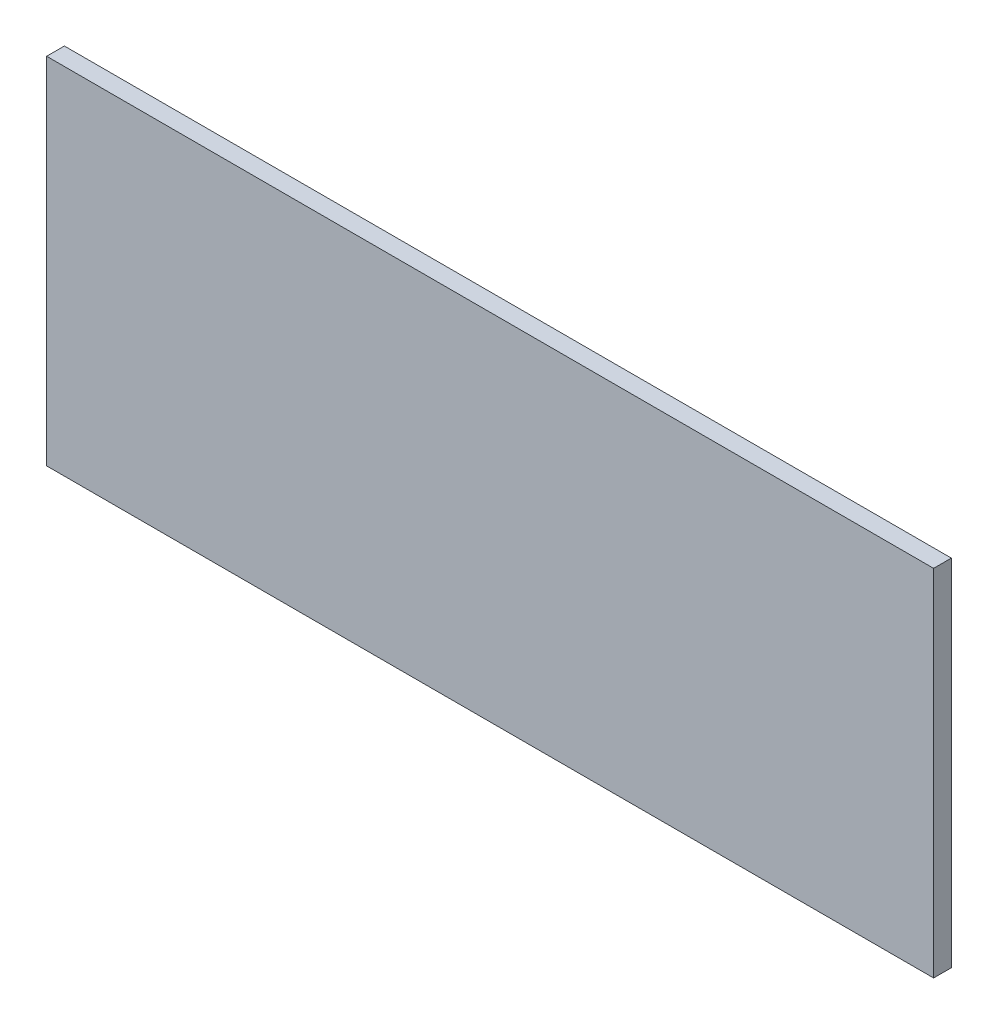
ISO-10303-21;
HEADER;
FILE_DESCRIPTION(('STEP AP214'),'2;1');
FILE_NAME('part.step','',(''),(''),'','','');
FILE_SCHEMA(('AUTOMOTIVE_DESIGN { 1 0 10303 214 1 1 1 1 }'));
ENDSEC;
DATA;
#1=APPLICATION_CONTEXT('core data for automotive mechanical design processes');
#2=APPLICATION_PROTOCOL_DEFINITION('international standard','automotive_design',2000,#1);
#3=PRODUCT_CONTEXT('',#1,'mechanical');
#4=PRODUCT('Part','Part','',(#3));
#5=PRODUCT_RELATED_PRODUCT_CATEGORY('part','',(#4));
#6=PRODUCT_DEFINITION_FORMATION('','',#4);
#7=PRODUCT_DEFINITION_CONTEXT('part definition',#1,'design');
#8=PRODUCT_DEFINITION('design','',#6,#7);
#9=PRODUCT_DEFINITION_SHAPE('','',#8);
#10=(LENGTH_UNIT() NAMED_UNIT(*) SI_UNIT(.MILLI.,.METRE.));
#11=(NAMED_UNIT(*) PLANE_ANGLE_UNIT() SI_UNIT($,.RADIAN.));
#12=(NAMED_UNIT(*) SI_UNIT($,.STERADIAN.) SOLID_ANGLE_UNIT());
#13=UNCERTAINTY_MEASURE_WITH_UNIT(LENGTH_MEASURE(1.E-05),#10,'distance_accuracy_value','');
#14=(GEOMETRIC_REPRESENTATION_CONTEXT(3) GLOBAL_UNCERTAINTY_ASSIGNED_CONTEXT((#13)) GLOBAL_UNIT_ASSIGNED_CONTEXT((#10,
#11,#12)) REPRESENTATION_CONTEXT('',''));
#15=CARTESIAN_POINT('',(0.,0.,0.));
#16=DIRECTION('',(0.,0.,1.));
#17=DIRECTION('',(1.,0.,0.));
#18=AXIS2_PLACEMENT_3D('',#15,#16,#17);
#19=CARTESIAN_POINT('',(-125.,50.,5.));
#20=DIRECTION('',(1.,0.,0.));
#21=DIRECTION('',(0.,1.,0.));
#22=AXIS2_PLACEMENT_3D('',#19,#20,#21);
#23=PLANE('',#22);
#24=DIRECTION('',(0.,-1.,0.));
#25=VECTOR('',#24,1.);
#26=CARTESIAN_POINT('',(-125.,50.,0.));
#27=LINE('',#26,#25);
#28=CARTESIAN_POINT('',(-125.,50.,0.));
#29=VERTEX_POINT('',#28);
#30=CARTESIAN_POINT('',(-125.,-50.,0.));
#31=VERTEX_POINT('',#30);
#32=EDGE_CURVE('E93',#29,#31,#27,.T.);
#33=ORIENTED_EDGE('',*,*,#32,.T.);
#34=DIRECTION('',(0.,0.,-1.));
#35=VECTOR('',#34,1.);
#36=CARTESIAN_POINT('',(-125.,-50.,5.));
#37=LINE('',#36,#35);
#38=CARTESIAN_POINT('',(-125.,-50.,5.));
#39=VERTEX_POINT('',#38);
#40=EDGE_CURVE('E11',#39,#31,#37,.T.);
#41=ORIENTED_EDGE('',*,*,#40,.F.);
#42=DIRECTION('',(0.,-1.,0.));
#43=VECTOR('',#42,1.);
#44=CARTESIAN_POINT('',(-125.,50.,5.));
#45=LINE('',#44,#43);
#46=CARTESIAN_POINT('',(-125.,50.,5.));
#47=VERTEX_POINT('',#46);
#48=EDGE_CURVE('E81',#47,#39,#45,.T.);
#49=ORIENTED_EDGE('',*,*,#48,.F.);
#50=DIRECTION('',(0.,0.,-1.));
#51=VECTOR('',#50,1.);
#52=CARTESIAN_POINT('',(-125.,50.,5.));
#53=LINE('',#52,#51);
#54=EDGE_CURVE('E89',#47,#29,#53,.T.);
#55=ORIENTED_EDGE('',*,*,#54,.T.);
#56=EDGE_LOOP('',(#33,#41,#49,#55));
#57=FACE_BOUND('',#56,.T.);
#58=ADVANCED_FACE('F30',(#57),#23,.F.);
#59=CARTESIAN_POINT('',(-125.,-50.,5.));
#60=DIRECTION('',(0.,1.,0.));
#61=DIRECTION('',(0.,0.,1.));
#62=AXIS2_PLACEMENT_3D('',#59,#60,#61);
#63=PLANE('',#62);
#64=DIRECTION('',(1.,0.,0.));
#65=VECTOR('',#64,1.);
#66=CARTESIAN_POINT('',(-125.,-50.,0.));
#67=LINE('',#66,#65);
#68=CARTESIAN_POINT('',(125.,-50.,0.));
#69=VERTEX_POINT('',#68);
#70=EDGE_CURVE('E85',#31,#69,#67,.T.);
#71=ORIENTED_EDGE('',*,*,#70,.T.);
#72=DIRECTION('',(0.,0.,-1.));
#73=VECTOR('',#72,1.);
#74=CARTESIAN_POINT('',(125.,-50.,5.));
#75=LINE('',#74,#73);
#76=CARTESIAN_POINT('',(125.,-50.,5.));
#77=VERTEX_POINT('',#76);
#78=EDGE_CURVE('E38',#77,#69,#75,.T.);
#79=ORIENTED_EDGE('',*,*,#78,.F.);
#80=DIRECTION('',(1.,0.,0.));
#81=VECTOR('',#80,1.);
#82=CARTESIAN_POINT('',(-125.,-50.,5.));
#83=LINE('',#82,#81);
#84=EDGE_CURVE('E76',#39,#77,#83,.T.);
#85=ORIENTED_EDGE('',*,*,#84,.F.);
#86=ORIENTED_EDGE('',*,*,#40,.T.);
#87=EDGE_LOOP('',(#71,#79,#85,#86));
#88=FACE_BOUND('',#87,.T.);
#89=ADVANCED_FACE('F84',(#88),#63,.F.);
#90=CARTESIAN_POINT('',(125.,50.,5.));
#91=DIRECTION('',(-1.,0.,0.));
#92=DIRECTION('',(0.,0.,1.));
#93=AXIS2_PLACEMENT_3D('',#90,#91,#92);
#94=PLANE('',#93);
#95=DIRECTION('',(0.,1.,0.));
#96=VECTOR('',#95,1.);
#97=CARTESIAN_POINT('',(125.,50.,0.));
#98=LINE('',#97,#96);
#99=CARTESIAN_POINT('',(125.,50.,0.));
#100=VERTEX_POINT('',#99);
#101=EDGE_CURVE('E63',#69,#100,#98,.T.);
#102=ORIENTED_EDGE('',*,*,#101,.T.);
#103=DIRECTION('',(0.,0.,-1.));
#104=VECTOR('',#103,1.);
#105=CARTESIAN_POINT('',(125.,50.,5.));
#106=LINE('',#105,#104);
#107=CARTESIAN_POINT('',(125.,50.,5.));
#108=VERTEX_POINT('',#107);
#109=EDGE_CURVE('E86',#108,#100,#106,.T.);
#110=ORIENTED_EDGE('',*,*,#109,.F.);
#111=DIRECTION('',(0.,1.,0.));
#112=VECTOR('',#111,1.);
#113=CARTESIAN_POINT('',(125.,50.,5.));
#114=LINE('',#113,#112);
#115=EDGE_CURVE('E79',#77,#108,#114,.T.);
#116=ORIENTED_EDGE('',*,*,#115,.F.);
#117=ORIENTED_EDGE('',*,*,#78,.T.);
#118=EDGE_LOOP('',(#102,#110,#116,#117));
#119=FACE_BOUND('',#118,.T.);
#120=ADVANCED_FACE('F87',(#119),#94,.F.);
#121=CARTESIAN_POINT('',(-125.,50.,5.));
#122=DIRECTION('',(0.,-1.,0.));
#123=DIRECTION('',(1.,0.,0.));
#124=AXIS2_PLACEMENT_3D('',#121,#122,#123);
#125=PLANE('',#124);
#126=DIRECTION('',(-1.,0.,0.));
#127=VECTOR('',#126,1.);
#128=CARTESIAN_POINT('',(-125.,50.,0.));
#129=LINE('',#128,#127);
#130=EDGE_CURVE('E69',#100,#29,#129,.T.);
#131=ORIENTED_EDGE('',*,*,#130,.T.);
#132=ORIENTED_EDGE('',*,*,#54,.F.);
#133=DIRECTION('',(-1.,0.,0.));
#134=VECTOR('',#133,1.);
#135=CARTESIAN_POINT('',(-125.,50.,5.));
#136=LINE('',#135,#134);
#137=EDGE_CURVE('E46',#108,#47,#136,.T.);
#138=ORIENTED_EDGE('',*,*,#137,.F.);
#139=ORIENTED_EDGE('',*,*,#109,.T.);
#140=EDGE_LOOP('',(#131,#132,#138,#139));
#141=FACE_BOUND('',#140,.T.);
#142=ADVANCED_FACE('F100',(#141),#125,.F.);
#143=CARTESIAN_POINT('',(-125.,-50.,5.));
#144=DIRECTION('',(0.,0.,1.));
#145=DIRECTION('',(1.,0.,0.));
#146=AXIS2_PLACEMENT_3D('',#143,#144,#145);
#147=PLANE('',#146);
#148=ORIENTED_EDGE('',*,*,#48,.T.);
#149=ORIENTED_EDGE('',*,*,#84,.T.);
#150=ORIENTED_EDGE('',*,*,#115,.T.);
#151=ORIENTED_EDGE('',*,*,#137,.T.);
#152=EDGE_LOOP('',(#148,#149,#150,#151));
#153=FACE_BOUND('',#152,.T.);
#154=ADVANCED_FACE('F77',(#153),#147,.T.);
#155=CARTESIAN_POINT('',(-125.,-50.,0.));
#156=DIRECTION('',(0.,0.,1.));
#157=DIRECTION('',(1.,0.,0.));
#158=AXIS2_PLACEMENT_3D('',#155,#156,#157);
#159=PLANE('',#158);
#160=ORIENTED_EDGE('',*,*,#32,.F.);
#161=ORIENTED_EDGE('',*,*,#130,.F.);
#162=ORIENTED_EDGE('',*,*,#101,.F.);
#163=ORIENTED_EDGE('',*,*,#70,.F.);
#164=EDGE_LOOP('',(#160,#161,#162,#163));
#165=FACE_BOUND('',#164,.T.);
#166=ADVANCED_FACE('F103',(#165),#159,.F.);
#167=CLOSED_SHELL('',(#58,#89,#120,#142,#154,#166));
#168=MANIFOLD_SOLID_BREP('B2',#167);
#169=ADVANCED_BREP_SHAPE_REPRESENTATION('',(#18,#168),#14);
#170=SHAPE_DEFINITION_REPRESENTATION(#9,#169);
ENDSEC;
END-ISO-10303-21;
